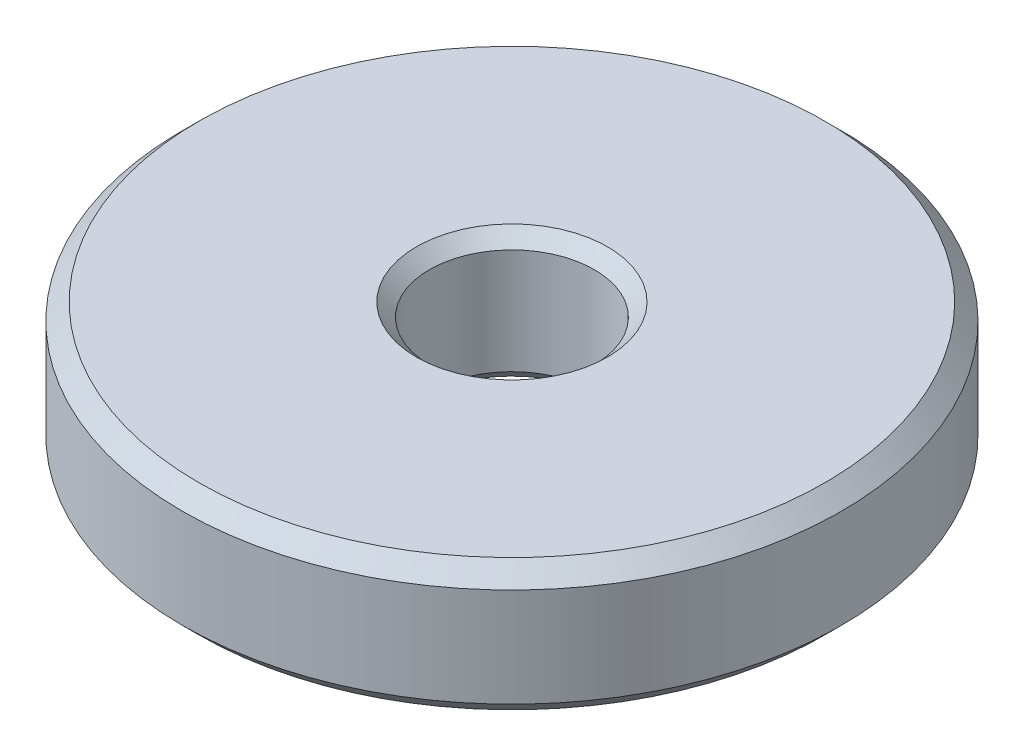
ISO-10303-21;
HEADER;
FILE_DESCRIPTION(('STEP AP214'),'2;1');
FILE_NAME('part.step','',(''),(''),'','','');
FILE_SCHEMA(('AUTOMOTIVE_DESIGN { 1 0 10303 214 1 1 1 1 }'));
ENDSEC;
DATA;
#1=APPLICATION_CONTEXT('core data for automotive mechanical design processes');
#2=APPLICATION_PROTOCOL_DEFINITION('international standard','automotive_design',2000,#1);
#3=PRODUCT_CONTEXT('',#1,'mechanical');
#4=PRODUCT('Part','Part','',(#3));
#5=PRODUCT_RELATED_PRODUCT_CATEGORY('part','',(#4));
#6=PRODUCT_DEFINITION_FORMATION('','',#4);
#7=PRODUCT_DEFINITION_CONTEXT('part definition',#1,'design');
#8=PRODUCT_DEFINITION('design','',#6,#7);
#9=PRODUCT_DEFINITION_SHAPE('','',#8);
#10=(LENGTH_UNIT() NAMED_UNIT(*) SI_UNIT(.MILLI.,.METRE.));
#11=(NAMED_UNIT(*) PLANE_ANGLE_UNIT() SI_UNIT($,.RADIAN.));
#12=(NAMED_UNIT(*) SI_UNIT($,.STERADIAN.) SOLID_ANGLE_UNIT());
#13=UNCERTAINTY_MEASURE_WITH_UNIT(LENGTH_MEASURE(1.E-05),#10,'distance_accuracy_value','');
#14=(GEOMETRIC_REPRESENTATION_CONTEXT(3) GLOBAL_UNCERTAINTY_ASSIGNED_CONTEXT((#13)) GLOBAL_UNIT_ASSIGNED_CONTEXT((#10,
#11,#12)) REPRESENTATION_CONTEXT('',''));
#15=CARTESIAN_POINT('',(0.,0.,0.));
#16=DIRECTION('',(0.,0.,1.));
#17=DIRECTION('',(1.,0.,0.));
#18=AXIS2_PLACEMENT_3D('',#15,#16,#17);
#19=CARTESIAN_POINT('',(0.,4.,0.));
#20=DIRECTION('',(0.,-1.,0.));
#21=DIRECTION('',(0.,0.,-1.));
#22=AXIS2_PLACEMENT_3D('',#19,#20,#21);
#23=CYLINDRICAL_SURFACE('',#22,10.);
#24=CARTESIAN_POINT('',(0.,0.5,0.));
#25=DIRECTION('',(0.,1.,0.));
#26=DIRECTION('',(0.,0.,1.));
#27=AXIS2_PLACEMENT_3D('',#24,#25,#26);
#28=CIRCLE('',#27,10.);
#29=CARTESIAN_POINT('',(0.,0.5,10.));
#30=VERTEX_POINT('',#29);
#31=EDGE_CURVE('E26',#30,#30,#28,.T.);
#32=ORIENTED_EDGE('',*,*,#31,.T.);
#33=EDGE_LOOP('',(#32));
#34=FACE_BOUND('',#33,.T.);
#35=CARTESIAN_POINT('',(0.,3.5,0.));
#36=DIRECTION('',(0.,1.,0.));
#37=DIRECTION('',(0.,0.,1.));
#38=AXIS2_PLACEMENT_3D('',#35,#36,#37);
#39=CIRCLE('',#38,10.);
#40=CARTESIAN_POINT('',(0.,3.5,10.));
#41=VERTEX_POINT('',#40);
#42=EDGE_CURVE('E30',#41,#41,#39,.F.);
#43=ORIENTED_EDGE('',*,*,#42,.T.);
#44=EDGE_LOOP('',(#43));
#45=FACE_BOUND('',#44,.T.);
#46=ADVANCED_FACE('F15',(#34,#45),#23,.T.);
#47=CARTESIAN_POINT('',(0.,4.,0.));
#48=DIRECTION('',(0.,1.,0.));
#49=DIRECTION('',(0.,0.,1.));
#50=AXIS2_PLACEMENT_3D('',#47,#48,#49);
#51=PLANE('',#50);
#52=CARTESIAN_POINT('',(0.,4.,0.));
#53=DIRECTION('',(0.,1.,0.));
#54=DIRECTION('',(0.,0.,1.));
#55=AXIS2_PLACEMENT_3D('',#52,#53,#54);
#56=CIRCLE('',#55,2.9);
#57=CARTESIAN_POINT('',(0.,4.,2.9));
#58=VERTEX_POINT('',#57);
#59=EDGE_CURVE('E44',#58,#58,#56,.T.);
#60=ORIENTED_EDGE('',*,*,#59,.F.);
#61=EDGE_LOOP('',(#60));
#62=FACE_BOUND('',#61,.T.);
#63=CARTESIAN_POINT('',(0.,4.,0.));
#64=DIRECTION('',(0.,1.,0.));
#65=DIRECTION('',(0.,0.,1.));
#66=AXIS2_PLACEMENT_3D('',#63,#64,#65);
#67=CIRCLE('',#66,9.5);
#68=CARTESIAN_POINT('',(0.,4.,9.5));
#69=VERTEX_POINT('',#68);
#70=EDGE_CURVE('E10',#69,#69,#67,.T.);
#71=ORIENTED_EDGE('',*,*,#70,.T.);
#72=EDGE_LOOP('',(#71));
#73=FACE_BOUND('',#72,.T.);
#74=ADVANCED_FACE('F50',(#62,#73),#51,.T.);
#75=CARTESIAN_POINT('',(0.,0.,0.));
#76=DIRECTION('',(0.,1.,0.));
#77=DIRECTION('',(0.,0.,1.));
#78=AXIS2_PLACEMENT_3D('',#75,#76,#77);
#79=PLANE('',#78);
#80=CARTESIAN_POINT('',(0.,0.,0.));
#81=DIRECTION('',(0.,1.,0.));
#82=DIRECTION('',(0.,0.,1.));
#83=AXIS2_PLACEMENT_3D('',#80,#81,#82);
#84=CIRCLE('',#83,2.9);
#85=CARTESIAN_POINT('',(0.,0.,2.9));
#86=VERTEX_POINT('',#85);
#87=EDGE_CURVE('E35',#86,#86,#84,.T.);
#88=ORIENTED_EDGE('',*,*,#87,.T.);
#89=EDGE_LOOP('',(#88));
#90=FACE_BOUND('',#89,.T.);
#91=CARTESIAN_POINT('',(0.,0.,0.));
#92=DIRECTION('',(0.,1.,0.));
#93=DIRECTION('',(0.,0.,1.));
#94=AXIS2_PLACEMENT_3D('',#91,#92,#93);
#95=CIRCLE('',#94,9.5);
#96=CARTESIAN_POINT('',(0.,0.,9.5));
#97=VERTEX_POINT('',#96);
#98=EDGE_CURVE('E22',#97,#97,#95,.F.);
#99=ORIENTED_EDGE('',*,*,#98,.T.);
#100=EDGE_LOOP('',(#99));
#101=FACE_BOUND('',#100,.T.);
#102=ADVANCED_FACE('F52',(#90,#101),#79,.F.);
#103=CARTESIAN_POINT('',(0.,0.5,0.));
#104=DIRECTION('',(0.,1.,0.));
#105=DIRECTION('',(0.,0.,1.));
#106=AXIS2_PLACEMENT_3D('',#103,#104,#105);
#107=CONICAL_SURFACE('',#106,10.,0.785398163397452);
#108=ORIENTED_EDGE('',*,*,#98,.F.);
#109=EDGE_LOOP('',(#108));
#110=FACE_BOUND('',#109,.T.);
#111=ORIENTED_EDGE('',*,*,#31,.F.);
#112=EDGE_LOOP('',(#111));
#113=FACE_BOUND('',#112,.T.);
#114=ADVANCED_FACE('F60',(#110,#113),#107,.T.);
#115=CARTESIAN_POINT('',(0.,4.,0.));
#116=DIRECTION('',(0.,-1.,0.));
#117=DIRECTION('',(0.,0.,-1.));
#118=AXIS2_PLACEMENT_3D('',#115,#116,#117);
#119=CONICAL_SURFACE('',#118,9.5,0.785398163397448);
#120=ORIENTED_EDGE('',*,*,#42,.F.);
#121=EDGE_LOOP('',(#120));
#122=FACE_BOUND('',#121,.T.);
#123=ORIENTED_EDGE('',*,*,#70,.F.);
#124=EDGE_LOOP('',(#123));
#125=FACE_BOUND('',#124,.T.);
#126=ADVANCED_FACE('F17',(#122,#125),#119,.T.);
#127=CARTESIAN_POINT('',(0.,0.4,0.));
#128=DIRECTION('',(0.,-1.,0.));
#129=DIRECTION('',(0.,0.,-1.));
#130=AXIS2_PLACEMENT_3D('',#127,#128,#129);
#131=CONICAL_SURFACE('',#130,2.5,0.785398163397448);
#132=ORIENTED_EDGE('',*,*,#87,.F.);
#133=EDGE_LOOP('',(#132));
#134=FACE_BOUND('',#133,.T.);
#135=CARTESIAN_POINT('',(0.,0.4,0.));
#136=DIRECTION('',(0.,1.,0.));
#137=DIRECTION('',(0.,0.,1.));
#138=AXIS2_PLACEMENT_3D('',#135,#136,#137);
#139=CIRCLE('',#138,2.5);
#140=CARTESIAN_POINT('',(0.,0.4,2.5));
#141=VERTEX_POINT('',#140);
#142=EDGE_CURVE('E38',#141,#141,#139,.T.);
#143=ORIENTED_EDGE('',*,*,#142,.T.);
#144=EDGE_LOOP('',(#143));
#145=FACE_BOUND('',#144,.T.);
#146=ADVANCED_FACE('F66',(#134,#145),#131,.F.);
#147=CARTESIAN_POINT('',(0.,4.,0.));
#148=DIRECTION('',(0.,1.,0.));
#149=DIRECTION('',(0.,0.,1.));
#150=AXIS2_PLACEMENT_3D('',#147,#148,#149);
#151=CYLINDRICAL_SURFACE('',#150,2.5);
#152=ORIENTED_EDGE('',*,*,#142,.F.);
#153=EDGE_LOOP('',(#152));
#154=FACE_BOUND('',#153,.T.);
#155=CARTESIAN_POINT('',(0.,3.6,0.));
#156=DIRECTION('',(0.,1.,0.));
#157=DIRECTION('',(0.,0.,1.));
#158=AXIS2_PLACEMENT_3D('',#155,#156,#157);
#159=CIRCLE('',#158,2.5);
#160=CARTESIAN_POINT('',(0.,3.6,2.5));
#161=VERTEX_POINT('',#160);
#162=EDGE_CURVE('E41',#161,#161,#159,.T.);
#163=ORIENTED_EDGE('',*,*,#162,.T.);
#164=EDGE_LOOP('',(#163));
#165=FACE_BOUND('',#164,.T.);
#166=ADVANCED_FACE('F84',(#154,#165),#151,.F.);
#167=CARTESIAN_POINT('',(0.,4.,0.));
#168=DIRECTION('',(0.,1.,0.));
#169=DIRECTION('',(0.,0.,1.));
#170=AXIS2_PLACEMENT_3D('',#167,#168,#169);
#171=CONICAL_SURFACE('',#170,2.9,0.78539816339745);
#172=ORIENTED_EDGE('',*,*,#162,.F.);
#173=EDGE_LOOP('',(#172));
#174=FACE_BOUND('',#173,.T.);
#175=ORIENTED_EDGE('',*,*,#59,.T.);
#176=EDGE_LOOP('',(#175));
#177=FACE_BOUND('',#176,.T.);
#178=ADVANCED_FACE('F48',(#174,#177),#171,.F.);
#179=CLOSED_SHELL('',(#46,#74,#102,#114,#126,#146,#166,#178));
#180=MANIFOLD_SOLID_BREP('B1',#179);
#181=ADVANCED_BREP_SHAPE_REPRESENTATION('',(#18,#180),#14);
#182=SHAPE_DEFINITION_REPRESENTATION(#9,#181);
ENDSEC;
END-ISO-10303-21;
